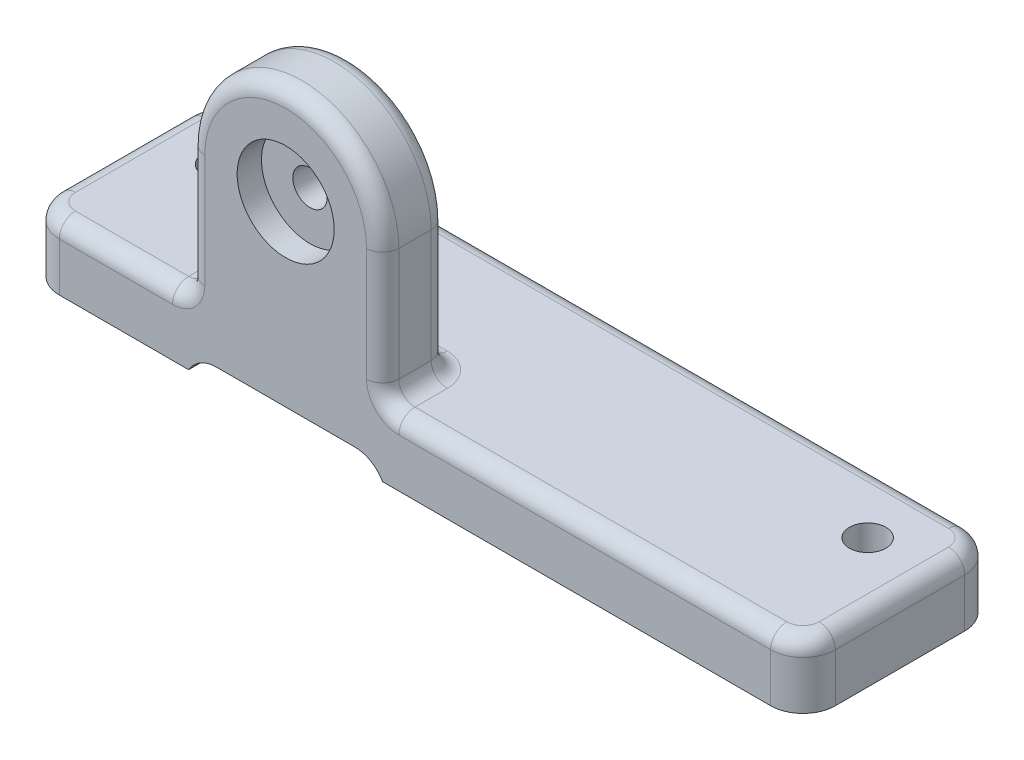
ISO-10303-21;
HEADER;
FILE_DESCRIPTION(('STEP AP214'),'2;1');
FILE_NAME('part.step','',(''),(''),'','','');
FILE_SCHEMA(('AUTOMOTIVE_DESIGN { 1 0 10303 214 1 1 1 1 }'));
ENDSEC;
DATA;
#1=APPLICATION_CONTEXT('core data for automotive mechanical design processes');
#2=APPLICATION_PROTOCOL_DEFINITION('international standard','automotive_design',2000,#1);
#3=PRODUCT_CONTEXT('',#1,'mechanical');
#4=PRODUCT('Part','Part','',(#3));
#5=PRODUCT_RELATED_PRODUCT_CATEGORY('part','',(#4));
#6=PRODUCT_DEFINITION_FORMATION('','',#4);
#7=PRODUCT_DEFINITION_CONTEXT('part definition',#1,'design');
#8=PRODUCT_DEFINITION('design','',#6,#7);
#9=PRODUCT_DEFINITION_SHAPE('','',#8);
#10=(LENGTH_UNIT() NAMED_UNIT(*) SI_UNIT(.MILLI.,.METRE.));
#11=(NAMED_UNIT(*) PLANE_ANGLE_UNIT() SI_UNIT($,.RADIAN.));
#12=(NAMED_UNIT(*) SI_UNIT($,.STERADIAN.) SOLID_ANGLE_UNIT());
#13=UNCERTAINTY_MEASURE_WITH_UNIT(LENGTH_MEASURE(1.E-05),#10,'distance_accuracy_value','');
#14=(GEOMETRIC_REPRESENTATION_CONTEXT(3) GLOBAL_UNCERTAINTY_ASSIGNED_CONTEXT((#13)) GLOBAL_UNIT_ASSIGNED_CONTEXT((#10,
#11,#12)) REPRESENTATION_CONTEXT('',''));
#15=CARTESIAN_POINT('',(0.,0.,0.));
#16=DIRECTION('',(0.,0.,1.));
#17=DIRECTION('',(1.,0.,0.));
#18=AXIS2_PLACEMENT_3D('',#15,#16,#17);
#19=CARTESIAN_POINT('',(0.,0.,-38.1));
#20=DIRECTION('',(0.,-1.,0.));
#21=DIRECTION('',(0.,0.,-1.));
#22=AXIS2_PLACEMENT_3D('',#19,#20,#21);
#23=PLANE('',#22);
#24=DIRECTION('',(0.,0.,1.));
#25=VECTOR('',#24,1.);
#26=CARTESIAN_POINT('',(0.,0.,0.));
#27=LINE('',#26,#25);
#28=CARTESIAN_POINT('',(0.,0.,-31.75));
#29=VERTEX_POINT('',#28);
#30=CARTESIAN_POINT('',(0.,0.,-6.35));
#31=VERTEX_POINT('',#30);
#32=EDGE_CURVE('E273',#29,#31,#27,.T.);
#33=ORIENTED_EDGE('',*,*,#32,.F.);
#34=CARTESIAN_POINT('',(6.35,0.,-31.75));
#35=DIRECTION('',(0.,-1.,0.));
#36=DIRECTION('',(0.,0.,-1.));
#37=AXIS2_PLACEMENT_3D('',#34,#35,#36);
#38=CIRCLE('',#37,6.35);
#39=CARTESIAN_POINT('',(6.35,0.,-38.1));
#40=VERTEX_POINT('',#39);
#41=EDGE_CURVE('E222',#29,#40,#38,.T.);
#42=ORIENTED_EDGE('',*,*,#41,.T.);
#43=DIRECTION('',(-1.,0.,0.));
#44=VECTOR('',#43,1.);
#45=CARTESIAN_POINT('',(0.,0.,-38.1));
#46=LINE('',#45,#44);
#47=CARTESIAN_POINT('',(31.75,0.,-38.1));
#48=VERTEX_POINT('',#47);
#49=EDGE_CURVE('E238',#48,#40,#46,.T.);
#50=ORIENTED_EDGE('',*,*,#49,.F.);
#51=DIRECTION('',(0.,0.,1.));
#52=VECTOR('',#51,1.);
#53=CARTESIAN_POINT('',(31.75,0.,-38.1));
#54=LINE('',#53,#52);
#55=CARTESIAN_POINT('',(31.75,0.,0.));
#56=VERTEX_POINT('',#55);
#57=EDGE_CURVE('E216',#48,#56,#54,.T.);
#58=ORIENTED_EDGE('',*,*,#57,.T.);
#59=DIRECTION('',(1.,0.,0.));
#60=VECTOR('',#59,1.);
#61=CARTESIAN_POINT('',(0.,0.,0.));
#62=LINE('',#61,#60);
#63=CARTESIAN_POINT('',(6.35,0.,0.));
#64=VERTEX_POINT('',#63);
#65=EDGE_CURVE('E225',#64,#56,#62,.T.);
#66=ORIENTED_EDGE('',*,*,#65,.F.);
#67=CARTESIAN_POINT('',(6.35,0.,-6.35));
#68=DIRECTION('',(0.,-1.,0.));
#69=DIRECTION('',(0.,0.,-1.));
#70=AXIS2_PLACEMENT_3D('',#67,#68,#69);
#71=CIRCLE('',#70,6.35);
#72=EDGE_CURVE('E311',#64,#31,#71,.T.);
#73=ORIENTED_EDGE('',*,*,#72,.T.);
#74=EDGE_LOOP('',(#33,#42,#50,#58,#66,#73));
#75=FACE_BOUND('',#74,.T.);
#76=CARTESIAN_POINT('',(12.7,0.,-25.4));
#77=DIRECTION('',(0.,1.,0.));
#78=DIRECTION('',(0.,0.,1.));
#79=AXIS2_PLACEMENT_3D('',#76,#77,#78);
#80=CIRCLE('',#79,3.57250999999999);
#81=CARTESIAN_POINT('',(12.7,0.,-21.82749));
#82=VERTEX_POINT('',#81);
#83=EDGE_CURVE('E264',#82,#82,#80,.T.);
#84=ORIENTED_EDGE('',*,*,#83,.T.);
#85=EDGE_LOOP('',(#84));
#86=FACE_BOUND('',#85,.T.);
#87=ADVANCED_FACE('F28',(#75,#86),#23,.T.);
#88=CARTESIAN_POINT('',(146.05,0.,-38.1));
#89=VERTEX_POINT('',#88);
#90=CARTESIAN_POINT('',(69.85,0.,-38.1));
#91=VERTEX_POINT('',#90);
#92=EDGE_CURVE('E280',#89,#91,#46,.T.);
#93=ORIENTED_EDGE('',*,*,#92,.F.);
#94=CARTESIAN_POINT('',(146.05,0.,-31.75));
#95=DIRECTION('',(0.,-1.,0.));
#96=DIRECTION('',(0.,0.,-1.));
#97=AXIS2_PLACEMENT_3D('',#94,#95,#96);
#98=CIRCLE('',#97,6.35);
#99=CARTESIAN_POINT('',(152.4,0.,-31.75));
#100=VERTEX_POINT('',#99);
#101=EDGE_CURVE('E295',#89,#100,#98,.T.);
#102=ORIENTED_EDGE('',*,*,#101,.T.);
#103=DIRECTION('',(0.,0.,-1.));
#104=VECTOR('',#103,1.);
#105=CARTESIAN_POINT('',(152.4,0.,0.));
#106=LINE('',#105,#104);
#107=CARTESIAN_POINT('',(152.4,0.,-6.35));
#108=VERTEX_POINT('',#107);
#109=EDGE_CURVE('E231',#108,#100,#106,.T.);
#110=ORIENTED_EDGE('',*,*,#109,.F.);
#111=CARTESIAN_POINT('',(146.05,0.,-6.35));
#112=DIRECTION('',(0.,-1.,0.));
#113=DIRECTION('',(0.,0.,-1.));
#114=AXIS2_PLACEMENT_3D('',#111,#112,#113);
#115=CIRCLE('',#114,6.35);
#116=CARTESIAN_POINT('',(146.05,0.,0.));
#117=VERTEX_POINT('',#116);
#118=EDGE_CURVE('E293',#108,#117,#115,.T.);
#119=ORIENTED_EDGE('',*,*,#118,.T.);
#120=CARTESIAN_POINT('',(69.85,0.,0.));
#121=VERTEX_POINT('',#120);
#122=EDGE_CURVE('E232',#121,#117,#62,.T.);
#123=ORIENTED_EDGE('',*,*,#122,.F.);
#124=DIRECTION('',(0.,0.,1.));
#125=VECTOR('',#124,1.);
#126=CARTESIAN_POINT('',(69.85,0.,-38.1));
#127=LINE('',#126,#125);
#128=EDGE_CURVE('E239',#91,#121,#127,.T.);
#129=ORIENTED_EDGE('',*,*,#128,.F.);
#130=EDGE_LOOP('',(#93,#102,#110,#119,#123,#129));
#131=FACE_BOUND('',#130,.T.);
#132=CARTESIAN_POINT('',(139.7,0.,-25.4));
#133=DIRECTION('',(0.,1.,0.));
#134=DIRECTION('',(0.,0.,1.));
#135=AXIS2_PLACEMENT_3D('',#132,#133,#134);
#136=CIRCLE('',#135,3.57251);
#137=CARTESIAN_POINT('',(139.7,0.,-21.82749));
#138=VERTEX_POINT('',#137);
#139=EDGE_CURVE('E258',#138,#138,#136,.T.);
#140=ORIENTED_EDGE('',*,*,#139,.T.);
#141=EDGE_LOOP('',(#140));
#142=FACE_BOUND('',#141,.T.);
#143=ADVANCED_FACE('F463',(#131,#142),#23,.T.);
#144=CARTESIAN_POINT('',(0.,12.7,0.));
#145=DIRECTION('',(1.,0.,0.));
#146=DIRECTION('',(0.,0.,-1.));
#147=AXIS2_PLACEMENT_3D('',#144,#145,#146);
#148=PLANE('',#147);
#149=DIRECTION('',(0.,-1.,0.));
#150=VECTOR('',#149,1.);
#151=CARTESIAN_POINT('',(0.,12.7,-6.35));
#152=LINE('',#151,#150);
#153=CARTESIAN_POINT('',(0.,9.525,-6.35));
#154=VERTEX_POINT('',#153);
#155=EDGE_CURVE('E306',#31,#154,#152,.F.);
#156=ORIENTED_EDGE('',*,*,#155,.T.);
#157=DIRECTION('',(0.,0.,1.));
#158=VECTOR('',#157,1.);
#159=CARTESIAN_POINT('',(0.,9.525,0.));
#160=LINE('',#159,#158);
#161=CARTESIAN_POINT('',(0.,9.525,-31.75));
#162=VERTEX_POINT('',#161);
#163=EDGE_CURVE('E353',#154,#162,#160,.F.);
#164=ORIENTED_EDGE('',*,*,#163,.T.);
#165=DIRECTION('',(0.,-1.,0.));
#166=VECTOR('',#165,1.);
#167=CARTESIAN_POINT('',(0.,12.7,-31.75));
#168=LINE('',#167,#166);
#169=EDGE_CURVE('E309',#162,#29,#168,.T.);
#170=ORIENTED_EDGE('',*,*,#169,.T.);
#171=ORIENTED_EDGE('',*,*,#32,.T.);
#172=EDGE_LOOP('',(#156,#164,#170,#171));
#173=FACE_BOUND('',#172,.T.);
#174=ADVANCED_FACE('F30',(#173),#148,.F.);
#175=CARTESIAN_POINT('',(0.,12.7,0.));
#176=DIRECTION('',(0.,0.,-1.));
#177=DIRECTION('',(-1.,0.,0.));
#178=AXIS2_PLACEMENT_3D('',#175,#176,#177);
#179=PLANE('',#178);
#180=CARTESIAN_POINT('',(50.8,38.1,0.));
#181=DIRECTION('',(0.,0.,1.));
#182=DIRECTION('',(1.,0.,0.));
#183=AXIS2_PLACEMENT_3D('',#180,#181,#182);
#184=CIRCLE('',#183,9.525);
#185=CARTESIAN_POINT('',(60.325,38.1,0.));
#186=VERTEX_POINT('',#185);
#187=EDGE_CURVE('E254',#186,#186,#184,.T.);
#188=ORIENTED_EDGE('',*,*,#187,.F.);
#189=EDGE_LOOP('',(#188));
#190=FACE_BOUND('',#189,.T.);
#191=CARTESIAN_POINT('',(28.575,15.875,0.));
#192=DIRECTION('',(0.,0.,-1.));
#193=DIRECTION('',(-1.,0.,0.));
#194=AXIS2_PLACEMENT_3D('',#191,#192,#193);
#195=CIRCLE('',#194,6.35);
#196=CARTESIAN_POINT('',(28.575,9.525,0.));
#197=VERTEX_POINT('',#196);
#198=CARTESIAN_POINT('',(34.925,15.875,0.));
#199=VERTEX_POINT('',#198);
#200=EDGE_CURVE('E372',#197,#199,#195,.F.);
#201=ORIENTED_EDGE('',*,*,#200,.F.);
#202=DIRECTION('',(1.,0.,0.));
#203=VECTOR('',#202,1.);
#204=CARTESIAN_POINT('',(0.,9.525,0.));
#205=LINE('',#204,#203);
#206=CARTESIAN_POINT('',(6.35,9.525,0.));
#207=VERTEX_POINT('',#206);
#208=EDGE_CURVE('E375',#197,#207,#205,.F.);
#209=ORIENTED_EDGE('',*,*,#208,.T.);
#210=DIRECTION('',(0.,-1.,0.));
#211=VECTOR('',#210,1.);
#212=CARTESIAN_POINT('',(6.35,12.7,0.));
#213=LINE('',#212,#211);
#214=EDGE_CURVE('E228',#207,#64,#213,.T.);
#215=ORIENTED_EDGE('',*,*,#214,.T.);
#216=ORIENTED_EDGE('',*,*,#65,.T.);
#217=CARTESIAN_POINT('',(37.2492613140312,-3.175,0.));
#218=DIRECTION('',(0.,0.,-1.));
#219=DIRECTION('',(-1.,0.,0.));
#220=AXIS2_PLACEMENT_3D('',#217,#218,#219);
#221=CIRCLE('',#220,6.35);
#222=CARTESIAN_POINT('',(37.2492613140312,3.175,0.));
#223=VERTEX_POINT('',#222);
#224=EDGE_CURVE('E211',#56,#223,#221,.T.);
#225=ORIENTED_EDGE('',*,*,#224,.T.);
#226=DIRECTION('',(-1.,0.,0.));
#227=VECTOR('',#226,1.);
#228=CARTESIAN_POINT('',(31.75,3.175,0.));
#229=LINE('',#228,#227);
#230=CARTESIAN_POINT('',(64.3507386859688,3.175,0.));
#231=VERTEX_POINT('',#230);
#232=EDGE_CURVE('E246',#231,#223,#229,.T.);
#233=ORIENTED_EDGE('',*,*,#232,.F.);
#234=CARTESIAN_POINT('',(64.3507386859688,-3.175,0.));
#235=DIRECTION('',(0.,0.,-1.));
#236=DIRECTION('',(-1.,0.,0.));
#237=AXIS2_PLACEMENT_3D('',#234,#235,#236);
#238=CIRCLE('',#237,6.35);
#239=EDGE_CURVE('E315',#231,#121,#238,.T.);
#240=ORIENTED_EDGE('',*,*,#239,.T.);
#241=ORIENTED_EDGE('',*,*,#122,.T.);
#242=DIRECTION('',(0.,-1.,0.));
#243=VECTOR('',#242,1.);
#244=CARTESIAN_POINT('',(146.05,12.7,0.));
#245=LINE('',#244,#243);
#246=CARTESIAN_POINT('',(146.05,9.525,0.));
#247=VERTEX_POINT('',#246);
#248=EDGE_CURVE('E303',#117,#247,#245,.F.);
#249=ORIENTED_EDGE('',*,*,#248,.T.);
#250=DIRECTION('',(1.,0.,0.));
#251=VECTOR('',#250,1.);
#252=CARTESIAN_POINT('',(0.,9.525,0.));
#253=LINE('',#252,#251);
#254=CARTESIAN_POINT('',(73.025,9.525,0.));
#255=VERTEX_POINT('',#254);
#256=EDGE_CURVE('E370',#247,#255,#253,.F.);
#257=ORIENTED_EDGE('',*,*,#256,.T.);
#258=CARTESIAN_POINT('',(73.025,15.875,0.));
#259=DIRECTION('',(0.,0.,-1.));
#260=DIRECTION('',(-1.,0.,0.));
#261=AXIS2_PLACEMENT_3D('',#258,#259,#260);
#262=CIRCLE('',#261,6.35);
#263=CARTESIAN_POINT('',(66.675,15.875,0.));
#264=VERTEX_POINT('',#263);
#265=EDGE_CURVE('E367',#264,#255,#262,.F.);
#266=ORIENTED_EDGE('',*,*,#265,.F.);
#267=DIRECTION('',(0.,1.,0.));
#268=VECTOR('',#267,1.);
#269=CARTESIAN_POINT('',(66.675,38.1,0.));
#270=LINE('',#269,#268);
#271=CARTESIAN_POINT('',(66.675,38.1,0.));
#272=VERTEX_POINT('',#271);
#273=EDGE_CURVE('E365',#264,#272,#270,.T.);
#274=ORIENTED_EDGE('',*,*,#273,.T.);
#275=CARTESIAN_POINT('',(50.8,38.1,0.));
#276=DIRECTION('',(0.,0.,-1.));
#277=DIRECTION('',(-1.,0.,0.));
#278=AXIS2_PLACEMENT_3D('',#275,#276,#277);
#279=CIRCLE('',#278,15.875);
#280=CARTESIAN_POINT('',(34.925,38.1,0.));
#281=VERTEX_POINT('',#280);
#282=EDGE_CURVE('E361',#272,#281,#279,.F.);
#283=ORIENTED_EDGE('',*,*,#282,.T.);
#284=DIRECTION('',(0.,-1.,0.));
#285=VECTOR('',#284,1.);
#286=CARTESIAN_POINT('',(34.925,12.7,0.));
#287=LINE('',#286,#285);
#288=EDGE_CURVE('E363',#281,#199,#287,.T.);
#289=ORIENTED_EDGE('',*,*,#288,.T.);
#290=EDGE_LOOP('',(#201,#209,#215,#216,#225,#233,#240,#241,#249,#257,#266,#274,#283,#289));
#291=FACE_BOUND('',#290,.T.);
#292=ADVANCED_FACE('F226',(#190,#291),#179,.F.);
#293=CARTESIAN_POINT('',(152.4,12.7,0.));
#294=DIRECTION('',(-1.,0.,0.));
#295=DIRECTION('',(0.,0.,1.));
#296=AXIS2_PLACEMENT_3D('',#293,#294,#295);
#297=PLANE('',#296);
#298=DIRECTION('',(0.,-1.,0.));
#299=VECTOR('',#298,1.);
#300=CARTESIAN_POINT('',(152.4,12.7,-31.75));
#301=LINE('',#300,#299);
#302=CARTESIAN_POINT('',(152.4,9.525,-31.75));
#303=VERTEX_POINT('',#302);
#304=EDGE_CURVE('E299',#100,#303,#301,.F.);
#305=ORIENTED_EDGE('',*,*,#304,.T.);
#306=DIRECTION('',(0.,0.,-1.));
#307=VECTOR('',#306,1.);
#308=CARTESIAN_POINT('',(152.4,9.525,0.));
#309=LINE('',#308,#307);
#310=CARTESIAN_POINT('',(152.4,9.525,-6.35));
#311=VERTEX_POINT('',#310);
#312=EDGE_CURVE('E377',#303,#311,#309,.F.);
#313=ORIENTED_EDGE('',*,*,#312,.T.);
#314=DIRECTION('',(0.,-1.,0.));
#315=VECTOR('',#314,1.);
#316=CARTESIAN_POINT('',(152.4,12.7,-6.35));
#317=LINE('',#316,#315);
#318=EDGE_CURVE('E297',#311,#108,#317,.T.);
#319=ORIENTED_EDGE('',*,*,#318,.T.);
#320=ORIENTED_EDGE('',*,*,#109,.T.);
#321=EDGE_LOOP('',(#305,#313,#319,#320));
#322=FACE_BOUND('',#321,.T.);
#323=ADVANCED_FACE('F476',(#322),#297,.F.);
#324=CARTESIAN_POINT('',(0.,12.7,-38.1));
#325=DIRECTION('',(0.,0.,1.));
#326=DIRECTION('',(1.,0.,0.));
#327=AXIS2_PLACEMENT_3D('',#324,#325,#326);
#328=PLANE('',#327);
#329=DIRECTION('',(0.,-1.,0.));
#330=VECTOR('',#329,1.);
#331=CARTESIAN_POINT('',(6.35,12.7,-38.1));
#332=LINE('',#331,#330);
#333=CARTESIAN_POINT('',(6.35,9.525,-38.1));
#334=VERTEX_POINT('',#333);
#335=EDGE_CURVE('E288',#40,#334,#332,.F.);
#336=ORIENTED_EDGE('',*,*,#335,.T.);
#337=DIRECTION('',(-1.,0.,0.));
#338=VECTOR('',#337,1.);
#339=CARTESIAN_POINT('',(0.,9.525,-38.1));
#340=LINE('',#339,#338);
#341=CARTESIAN_POINT('',(146.05,9.525,-38.1));
#342=VERTEX_POINT('',#341);
#343=EDGE_CURVE('E355',#334,#342,#340,.F.);
#344=ORIENTED_EDGE('',*,*,#343,.T.);
#345=DIRECTION('',(0.,-1.,0.));
#346=VECTOR('',#345,1.);
#347=CARTESIAN_POINT('',(146.05,12.7,-38.1));
#348=LINE('',#347,#346);
#349=EDGE_CURVE('E291',#342,#89,#348,.T.);
#350=ORIENTED_EDGE('',*,*,#349,.T.);
#351=ORIENTED_EDGE('',*,*,#92,.T.);
#352=CARTESIAN_POINT('',(64.3507386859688,-3.175,-38.1));
#353=DIRECTION('',(0.,0.,1.));
#354=DIRECTION('',(1.,0.,0.));
#355=AXIS2_PLACEMENT_3D('',#352,#353,#354);
#356=CIRCLE('',#355,6.35);
#357=CARTESIAN_POINT('',(64.3507386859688,3.175,-38.1));
#358=VERTEX_POINT('',#357);
#359=EDGE_CURVE('E317',#91,#358,#356,.T.);
#360=ORIENTED_EDGE('',*,*,#359,.T.);
#361=DIRECTION('',(-1.,0.,0.));
#362=VECTOR('',#361,1.);
#363=CARTESIAN_POINT('',(31.75,3.175,-38.1));
#364=LINE('',#363,#362);
#365=CARTESIAN_POINT('',(37.2492613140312,3.175,-38.1));
#366=VERTEX_POINT('',#365);
#367=EDGE_CURVE('E240',#358,#366,#364,.T.);
#368=ORIENTED_EDGE('',*,*,#367,.T.);
#369=CARTESIAN_POINT('',(37.2492613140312,-3.175,-38.1));
#370=DIRECTION('',(0.,0.,1.));
#371=DIRECTION('',(1.,0.,0.));
#372=AXIS2_PLACEMENT_3D('',#369,#370,#371);
#373=CIRCLE('',#372,6.35);
#374=EDGE_CURVE('E221',#366,#48,#373,.T.);
#375=ORIENTED_EDGE('',*,*,#374,.T.);
#376=ORIENTED_EDGE('',*,*,#49,.T.);
#377=EDGE_LOOP('',(#336,#344,#350,#351,#360,#368,#375,#376));
#378=FACE_BOUND('',#377,.T.);
#379=ADVANCED_FACE('F470',(#378),#328,.F.);
#380=CARTESIAN_POINT('',(0.,12.7,-38.1));
#381=DIRECTION('',(0.,-1.,0.));
#382=DIRECTION('',(0.,0.,-1.));
#383=AXIS2_PLACEMENT_3D('',#380,#381,#382);
#384=PLANE('',#383);
#385=DIRECTION('',(-1.,0.,0.));
#386=VECTOR('',#385,1.);
#387=CARTESIAN_POINT('',(0.,12.7,-34.925));
#388=LINE('',#387,#386);
#389=CARTESIAN_POINT('',(146.05,12.7,-34.925));
#390=VERTEX_POINT('',#389);
#391=CARTESIAN_POINT('',(6.35,12.7,-34.925));
#392=VERTEX_POINT('',#391);
#393=EDGE_CURVE('E343',#390,#392,#388,.T.);
#394=ORIENTED_EDGE('',*,*,#393,.T.);
#395=CARTESIAN_POINT('',(6.35,12.7,-31.75));
#396=DIRECTION('',(0.,-1.,0.));
#397=DIRECTION('',(0.,0.,-1.));
#398=AXIS2_PLACEMENT_3D('',#395,#396,#397);
#399=CIRCLE('',#398,3.175);
#400=CARTESIAN_POINT('',(3.175,12.7,-31.75));
#401=VERTEX_POINT('',#400);
#402=EDGE_CURVE('E347',#392,#401,#399,.F.);
#403=ORIENTED_EDGE('',*,*,#402,.T.);
#404=DIRECTION('',(0.,0.,1.));
#405=VECTOR('',#404,1.);
#406=CARTESIAN_POINT('',(3.175,12.7,-38.1));
#407=LINE('',#406,#405);
#408=CARTESIAN_POINT('',(3.175,12.7,-6.35));
#409=VERTEX_POINT('',#408);
#410=EDGE_CURVE('E345',#401,#409,#407,.T.);
#411=ORIENTED_EDGE('',*,*,#410,.T.);
#412=CARTESIAN_POINT('',(6.35,12.7,-6.35));
#413=DIRECTION('',(0.,-1.,0.));
#414=DIRECTION('',(0.,0.,-1.));
#415=AXIS2_PLACEMENT_3D('',#412,#413,#414);
#416=CIRCLE('',#415,3.175);
#417=CARTESIAN_POINT('',(6.35,12.7,-3.175));
#418=VERTEX_POINT('',#417);
#419=EDGE_CURVE('E341',#409,#418,#416,.F.);
#420=ORIENTED_EDGE('',*,*,#419,.T.);
#421=DIRECTION('',(1.,0.,0.));
#422=VECTOR('',#421,1.);
#423=CARTESIAN_POINT('',(0.,12.7,-3.175));
#424=LINE('',#423,#422);
#425=CARTESIAN_POINT('',(28.575,12.7,-3.175));
#426=VERTEX_POINT('',#425);
#427=EDGE_CURVE('E337',#418,#426,#424,.T.);
#428=ORIENTED_EDGE('',*,*,#427,.T.);
#429=DIRECTION('',(0.,0.,-1.));
#430=VECTOR('',#429,1.);
#431=CARTESIAN_POINT('',(28.575,12.7,-38.1));
#432=LINE('',#431,#430);
#433=CARTESIAN_POINT('',(28.575,12.7,-9.525));
#434=VERTEX_POINT('',#433);
#435=EDGE_CURVE('E333',#426,#434,#432,.T.);
#436=ORIENTED_EDGE('',*,*,#435,.T.);
#437=CARTESIAN_POINT('',(34.925,12.7,-9.525));
#438=DIRECTION('',(0.,-1.,0.));
#439=DIRECTION('',(0.,0.,-1.));
#440=AXIS2_PLACEMENT_3D('',#437,#438,#439);
#441=CIRCLE('',#440,6.35);
#442=CARTESIAN_POINT('',(34.925,12.7,-15.875));
#443=VERTEX_POINT('',#442);
#444=EDGE_CURVE('E330',#443,#434,#441,.F.);
#445=ORIENTED_EDGE('',*,*,#444,.F.);
#446=DIRECTION('',(1.,0.,0.));
#447=VECTOR('',#446,1.);
#448=CARTESIAN_POINT('',(0.,12.7,-15.875));
#449=LINE('',#448,#447);
#450=CARTESIAN_POINT('',(66.675,12.7,-15.875));
#451=VERTEX_POINT('',#450);
#452=EDGE_CURVE('E326',#443,#451,#449,.T.);
#453=ORIENTED_EDGE('',*,*,#452,.T.);
#454=CARTESIAN_POINT('',(66.675,12.7,-9.525));
#455=DIRECTION('',(0.,-1.,0.));
#456=DIRECTION('',(0.,0.,-1.));
#457=AXIS2_PLACEMENT_3D('',#454,#455,#456);
#458=CIRCLE('',#457,6.35);
#459=CARTESIAN_POINT('',(73.025,12.7,-9.525));
#460=VERTEX_POINT('',#459);
#461=EDGE_CURVE('E323',#460,#451,#458,.F.);
#462=ORIENTED_EDGE('',*,*,#461,.F.);
#463=DIRECTION('',(0.,0.,1.));
#464=VECTOR('',#463,1.);
#465=CARTESIAN_POINT('',(73.025,12.7,-38.1));
#466=LINE('',#465,#464);
#467=CARTESIAN_POINT('',(73.025,12.7,-3.175));
#468=VERTEX_POINT('',#467);
#469=EDGE_CURVE('E319',#460,#468,#466,.T.);
#470=ORIENTED_EDGE('',*,*,#469,.T.);
#471=DIRECTION('',(1.,0.,0.));
#472=VECTOR('',#471,1.);
#473=CARTESIAN_POINT('',(0.,12.7,-3.175));
#474=LINE('',#473,#472);
#475=CARTESIAN_POINT('',(146.05,12.7,-3.175));
#476=VERTEX_POINT('',#475);
#477=EDGE_CURVE('E321',#468,#476,#474,.T.);
#478=ORIENTED_EDGE('',*,*,#477,.T.);
#479=CARTESIAN_POINT('',(146.05,12.7,-6.35));
#480=DIRECTION('',(0.,-1.,0.));
#481=DIRECTION('',(0.,0.,-1.));
#482=AXIS2_PLACEMENT_3D('',#479,#480,#481);
#483=CIRCLE('',#482,3.175);
#484=CARTESIAN_POINT('',(149.225,12.7,-6.35));
#485=VERTEX_POINT('',#484);
#486=EDGE_CURVE('E328',#476,#485,#483,.F.);
#487=ORIENTED_EDGE('',*,*,#486,.T.);
#488=DIRECTION('',(0.,0.,-1.));
#489=VECTOR('',#488,1.);
#490=CARTESIAN_POINT('',(149.225,12.7,-38.1));
#491=LINE('',#490,#489);
#492=CARTESIAN_POINT('',(149.225,12.7,-31.75));
#493=VERTEX_POINT('',#492);
#494=EDGE_CURVE('E335',#485,#493,#491,.T.);
#495=ORIENTED_EDGE('',*,*,#494,.T.);
#496=CARTESIAN_POINT('',(146.05,12.7,-31.75));
#497=DIRECTION('',(0.,-1.,0.));
#498=DIRECTION('',(0.,0.,-1.));
#499=AXIS2_PLACEMENT_3D('',#496,#497,#498);
#500=CIRCLE('',#499,3.175);
#501=EDGE_CURVE('E339',#493,#390,#500,.F.);
#502=ORIENTED_EDGE('',*,*,#501,.T.);
#503=EDGE_LOOP('',(#394,#403,#411,#420,#428,#436,#445,#453,#462,#470,#478,#487,#495,#502));
#504=FACE_BOUND('',#503,.T.);
#505=CARTESIAN_POINT('',(139.7,12.7,-25.4));
#506=DIRECTION('',(0.,1.,0.));
#507=DIRECTION('',(0.,0.,1.));
#508=AXIS2_PLACEMENT_3D('',#505,#506,#507);
#509=CIRCLE('',#508,3.57251);
#510=CARTESIAN_POINT('',(139.7,12.7,-21.82749));
#511=VERTEX_POINT('',#510);
#512=EDGE_CURVE('E261',#511,#511,#509,.T.);
#513=ORIENTED_EDGE('',*,*,#512,.F.);
#514=EDGE_LOOP('',(#513));
#515=FACE_BOUND('',#514,.T.);
#516=CARTESIAN_POINT('',(12.7,12.7,-25.4));
#517=DIRECTION('',(0.,1.,0.));
#518=DIRECTION('',(0.,0.,1.));
#519=AXIS2_PLACEMENT_3D('',#516,#517,#518);
#520=CIRCLE('',#519,3.57250999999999);
#521=CARTESIAN_POINT('',(12.7,12.7,-21.82749));
#522=VERTEX_POINT('',#521);
#523=EDGE_CURVE('E267',#522,#522,#520,.T.);
#524=ORIENTED_EDGE('',*,*,#523,.F.);
#525=EDGE_LOOP('',(#524));
#526=FACE_BOUND('',#525,.T.);
#527=ADVANCED_FACE('F534',(#504,#515,#526),#384,.F.);
#528=CARTESIAN_POINT('',(69.85,38.1,-12.7));
#529=DIRECTION('',(1.,0.,0.));
#530=DIRECTION('',(0.,1.,0.));
#531=AXIS2_PLACEMENT_3D('',#528,#529,#530);
#532=PLANE('',#531);
#533=DIRECTION('',(0.,0.,1.));
#534=VECTOR('',#533,1.);
#535=CARTESIAN_POINT('',(69.85,15.875,-12.7));
#536=LINE('',#535,#534);
#537=CARTESIAN_POINT('',(69.85,15.875,-3.175));
#538=VERTEX_POINT('',#537);
#539=CARTESIAN_POINT('',(69.85,15.875,-9.525));
#540=VERTEX_POINT('',#539);
#541=EDGE_CURVE('E43',#538,#540,#536,.F.);
#542=ORIENTED_EDGE('',*,*,#541,.T.);
#543=DIRECTION('',(0.,1.,0.));
#544=VECTOR('',#543,1.);
#545=CARTESIAN_POINT('',(69.85,38.1,-9.525));
#546=LINE('',#545,#544);
#547=CARTESIAN_POINT('',(69.85,38.1,-9.525));
#548=VERTEX_POINT('',#547);
#549=EDGE_CURVE('E399',#540,#548,#546,.T.);
#550=ORIENTED_EDGE('',*,*,#549,.T.);
#551=DIRECTION('',(0.,0.,1.));
#552=VECTOR('',#551,1.);
#553=CARTESIAN_POINT('',(69.85,38.1,-12.7));
#554=LINE('',#553,#552);
#555=CARTESIAN_POINT('',(69.85,38.1,-3.175));
#556=VERTEX_POINT('',#555);
#557=EDGE_CURVE('E271',#548,#556,#554,.T.);
#558=ORIENTED_EDGE('',*,*,#557,.T.);
#559=DIRECTION('',(0.,1.,0.));
#560=VECTOR('',#559,1.);
#561=CARTESIAN_POINT('',(69.85,12.7,-3.175));
#562=LINE('',#561,#560);
#563=EDGE_CURVE('E48',#556,#538,#562,.F.);
#564=ORIENTED_EDGE('',*,*,#563,.T.);
#565=EDGE_LOOP('',(#542,#550,#558,#564));
#566=FACE_BOUND('',#565,.T.);
#567=ADVANCED_FACE('F410',(#566),#532,.T.);
#568=CARTESIAN_POINT('',(31.75,0.,-12.7));
#569=DIRECTION('',(-1.,0.,0.));
#570=DIRECTION('',(0.,0.,1.));
#571=AXIS2_PLACEMENT_3D('',#568,#569,#570);
#572=PLANE('',#571);
#573=DIRECTION('',(0.,0.,1.));
#574=VECTOR('',#573,1.);
#575=CARTESIAN_POINT('',(31.75,38.1,-12.7));
#576=LINE('',#575,#574);
#577=CARTESIAN_POINT('',(31.75,38.1,-9.525));
#578=VERTEX_POINT('',#577);
#579=CARTESIAN_POINT('',(31.75,38.1,-3.175));
#580=VERTEX_POINT('',#579);
#581=EDGE_CURVE('E270',#578,#580,#576,.T.);
#582=ORIENTED_EDGE('',*,*,#581,.F.);
#583=DIRECTION('',(0.,-1.,0.));
#584=VECTOR('',#583,1.);
#585=CARTESIAN_POINT('',(31.75,0.,-9.525));
#586=LINE('',#585,#584);
#587=CARTESIAN_POINT('',(31.75,15.875,-9.525));
#588=VERTEX_POINT('',#587);
#589=EDGE_CURVE('E384',#578,#588,#586,.T.);
#590=ORIENTED_EDGE('',*,*,#589,.T.);
#591=DIRECTION('',(0.,0.,-1.));
#592=VECTOR('',#591,1.);
#593=CARTESIAN_POINT('',(31.75,15.875,-12.7));
#594=LINE('',#593,#592);
#595=CARTESIAN_POINT('',(31.75,15.875,-3.175));
#596=VERTEX_POINT('',#595);
#597=EDGE_CURVE('E381',#588,#596,#594,.F.);
#598=ORIENTED_EDGE('',*,*,#597,.T.);
#599=DIRECTION('',(0.,-1.,0.));
#600=VECTOR('',#599,1.);
#601=CARTESIAN_POINT('',(31.75,38.1,-3.175));
#602=LINE('',#601,#600);
#603=EDGE_CURVE('E379',#596,#580,#602,.F.);
#604=ORIENTED_EDGE('',*,*,#603,.T.);
#605=EDGE_LOOP('',(#582,#590,#598,#604));
#606=FACE_BOUND('',#605,.T.);
#607=ADVANCED_FACE('F657',(#606),#572,.T.);
#608=CARTESIAN_POINT('',(50.8,38.1,-12.7));
#609=DIRECTION('',(0.,0.,-1.));
#610=DIRECTION('',(-1.,0.,0.));
#611=AXIS2_PLACEMENT_3D('',#608,#609,#610);
#612=PLANE('',#611);
#613=DIRECTION('',(0.,1.,0.));
#614=VECTOR('',#613,1.);
#615=CARTESIAN_POINT('',(66.675,38.1,-12.7));
#616=LINE('',#615,#614);
#617=CARTESIAN_POINT('',(66.675,38.1,-12.7));
#618=VERTEX_POINT('',#617);
#619=CARTESIAN_POINT('',(66.675,15.875,-12.7));
#620=VERTEX_POINT('',#619);
#621=EDGE_CURVE('E392',#618,#620,#616,.F.);
#622=ORIENTED_EDGE('',*,*,#621,.T.);
#623=DIRECTION('',(1.,0.,0.));
#624=VECTOR('',#623,1.);
#625=CARTESIAN_POINT('',(50.8,15.875,-12.7));
#626=LINE('',#625,#624);
#627=CARTESIAN_POINT('',(34.925,15.875,-12.7));
#628=VERTEX_POINT('',#627);
#629=EDGE_CURVE('E394',#620,#628,#626,.F.);
#630=ORIENTED_EDGE('',*,*,#629,.T.);
#631=DIRECTION('',(0.,-1.,0.));
#632=VECTOR('',#631,1.);
#633=CARTESIAN_POINT('',(34.925,38.1,-12.7));
#634=LINE('',#633,#632);
#635=CARTESIAN_POINT('',(34.925,38.1,-12.7));
#636=VERTEX_POINT('',#635);
#637=EDGE_CURVE('E390',#628,#636,#634,.F.);
#638=ORIENTED_EDGE('',*,*,#637,.T.);
#639=CARTESIAN_POINT('',(50.8,38.1,-12.7));
#640=DIRECTION('',(0.,0.,-1.));
#641=DIRECTION('',(-1.,0.,0.));
#642=AXIS2_PLACEMENT_3D('',#639,#640,#641);
#643=CIRCLE('',#642,15.875);
#644=EDGE_CURVE('E388',#636,#618,#643,.T.);
#645=ORIENTED_EDGE('',*,*,#644,.T.);
#646=EDGE_LOOP('',(#622,#630,#638,#645));
#647=FACE_BOUND('',#646,.T.);
#648=CARTESIAN_POINT('',(50.8,38.1,-12.7));
#649=DIRECTION('',(0.,0.,-1.));
#650=DIRECTION('',(-1.,0.,0.));
#651=AXIS2_PLACEMENT_3D('',#648,#649,#650);
#652=CIRCLE('',#651,3.3782);
#653=CARTESIAN_POINT('',(47.4218,38.1,-12.7));
#654=VERTEX_POINT('',#653);
#655=EDGE_CURVE('E257',#654,#654,#652,.T.);
#656=ORIENTED_EDGE('',*,*,#655,.F.);
#657=EDGE_LOOP('',(#656));
#658=FACE_BOUND('',#657,.T.);
#659=ADVANCED_FACE('F654',(#647,#658),#612,.T.);
#660=CARTESIAN_POINT('',(50.8,38.1,-12.7));
#661=DIRECTION('',(0.,0.,1.));
#662=DIRECTION('',(1.,0.,0.));
#663=AXIS2_PLACEMENT_3D('',#660,#661,#662);
#664=CYLINDRICAL_SURFACE('',#663,19.05);
#665=ORIENTED_EDGE('',*,*,#557,.F.);
#666=CARTESIAN_POINT('',(50.8,38.1,-9.525));
#667=DIRECTION('',(0.,0.,-1.));
#668=DIRECTION('',(-1.,0.,0.));
#669=AXIS2_PLACEMENT_3D('',#666,#667,#668);
#670=CIRCLE('',#669,19.05);
#671=EDGE_CURVE('E11',#548,#578,#670,.F.);
#672=ORIENTED_EDGE('',*,*,#671,.T.);
#673=ORIENTED_EDGE('',*,*,#581,.T.);
#674=CARTESIAN_POINT('',(50.8,38.1,-3.175));
#675=DIRECTION('',(0.,0.,-1.));
#676=DIRECTION('',(-1.,0.,0.));
#677=AXIS2_PLACEMENT_3D('',#674,#675,#676);
#678=CIRCLE('',#677,19.05);
#679=EDGE_CURVE('E36',#580,#556,#678,.T.);
#680=ORIENTED_EDGE('',*,*,#679,.T.);
#681=EDGE_LOOP('',(#665,#672,#673,#680));
#682=FACE_BOUND('',#681,.T.);
#683=ADVANCED_FACE('F403',(#682),#664,.T.);
#684=CARTESIAN_POINT('',(12.7,12.7,-25.4));
#685=DIRECTION('',(0.,1.,0.));
#686=DIRECTION('',(0.,0.,1.));
#687=AXIS2_PLACEMENT_3D('',#684,#685,#686);
#688=CYLINDRICAL_SURFACE('',#687,3.57250999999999);
#689=ORIENTED_EDGE('',*,*,#83,.F.);
#690=EDGE_LOOP('',(#689));
#691=FACE_BOUND('',#690,.T.);
#692=ORIENTED_EDGE('',*,*,#523,.T.);
#693=EDGE_LOOP('',(#692));
#694=FACE_BOUND('',#693,.T.);
#695=ADVANCED_FACE('F645',(#691,#694),#688,.F.);
#696=CARTESIAN_POINT('',(139.7,12.7,-25.4));
#697=DIRECTION('',(0.,1.,0.));
#698=DIRECTION('',(0.,0.,1.));
#699=AXIS2_PLACEMENT_3D('',#696,#697,#698);
#700=CYLINDRICAL_SURFACE('',#699,3.57251);
#701=ORIENTED_EDGE('',*,*,#139,.F.);
#702=EDGE_LOOP('',(#701));
#703=FACE_BOUND('',#702,.T.);
#704=ORIENTED_EDGE('',*,*,#512,.T.);
#705=EDGE_LOOP('',(#704));
#706=FACE_BOUND('',#705,.T.);
#707=ADVANCED_FACE('F635',(#703,#706),#700,.F.);
#708=CARTESIAN_POINT('',(50.8,38.1,0.));
#709=DIRECTION('',(0.,0.,1.));
#710=DIRECTION('',(1.,0.,0.));
#711=AXIS2_PLACEMENT_3D('',#708,#709,#710);
#712=CYLINDRICAL_SURFACE('',#711,9.525);
#713=CARTESIAN_POINT('',(50.8,38.1,-4.7752));
#714=DIRECTION('',(0.,0.,1.));
#715=DIRECTION('',(1.,0.,0.));
#716=AXIS2_PLACEMENT_3D('',#713,#714,#715);
#717=CIRCLE('',#716,9.525);
#718=CARTESIAN_POINT('',(60.325,38.1,-4.7752));
#719=VERTEX_POINT('',#718);
#720=EDGE_CURVE('E251',#719,#719,#717,.T.);
#721=ORIENTED_EDGE('',*,*,#720,.F.);
#722=EDGE_LOOP('',(#721));
#723=FACE_BOUND('',#722,.T.);
#724=ORIENTED_EDGE('',*,*,#187,.T.);
#725=EDGE_LOOP('',(#724));
#726=FACE_BOUND('',#725,.T.);
#727=ADVANCED_FACE('F632',(#723,#726),#712,.F.);
#728=CARTESIAN_POINT('',(54.1782,38.1,-4.7752));
#729=DIRECTION('',(0.,0.,-1.));
#730=DIRECTION('',(-1.,0.,0.));
#731=AXIS2_PLACEMENT_3D('',#728,#729,#730);
#732=PLANE('',#731);
#733=CARTESIAN_POINT('',(50.8,38.1,-4.7752));
#734=DIRECTION('',(0.,0.,1.));
#735=DIRECTION('',(1.,0.,0.));
#736=AXIS2_PLACEMENT_3D('',#733,#734,#735);
#737=CIRCLE('',#736,3.3782);
#738=CARTESIAN_POINT('',(54.1782,38.1,-4.7752));
#739=VERTEX_POINT('',#738);
#740=EDGE_CURVE('E243',#739,#739,#737,.T.);
#741=ORIENTED_EDGE('',*,*,#740,.F.);
#742=EDGE_LOOP('',(#741));
#743=FACE_BOUND('',#742,.T.);
#744=ORIENTED_EDGE('',*,*,#720,.T.);
#745=EDGE_LOOP('',(#744));
#746=FACE_BOUND('',#745,.T.);
#747=ADVANCED_FACE('F634',(#743,#746),#732,.F.);
#748=CARTESIAN_POINT('',(50.8,38.1,0.));
#749=DIRECTION('',(0.,0.,1.));
#750=DIRECTION('',(1.,0.,0.));
#751=AXIS2_PLACEMENT_3D('',#748,#749,#750);
#752=CYLINDRICAL_SURFACE('',#751,3.3782);
#753=ORIENTED_EDGE('',*,*,#655,.T.);
#754=EDGE_LOOP('',(#753));
#755=FACE_BOUND('',#754,.T.);
#756=ORIENTED_EDGE('',*,*,#740,.T.);
#757=EDGE_LOOP('',(#756));
#758=FACE_BOUND('',#757,.T.);
#759=ADVANCED_FACE('F642',(#755,#758),#752,.F.);
#760=CARTESIAN_POINT('',(31.75,3.175,-38.1));
#761=DIRECTION('',(0.,1.,0.));
#762=DIRECTION('',(0.,0.,1.));
#763=AXIS2_PLACEMENT_3D('',#760,#761,#762);
#764=PLANE('',#763);
#765=ORIENTED_EDGE('',*,*,#232,.T.);
#766=DIRECTION('',(0.,0.,1.));
#767=VECTOR('',#766,1.);
#768=CARTESIAN_POINT('',(37.2492613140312,3.175,-38.1));
#769=LINE('',#768,#767);
#770=EDGE_CURVE('E217',#223,#366,#769,.F.);
#771=ORIENTED_EDGE('',*,*,#770,.T.);
#772=ORIENTED_EDGE('',*,*,#367,.F.);
#773=DIRECTION('',(0.,0.,-1.));
#774=VECTOR('',#773,1.);
#775=CARTESIAN_POINT('',(64.3507386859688,3.175,-38.1));
#776=LINE('',#775,#774);
#777=EDGE_CURVE('E282',#358,#231,#776,.F.);
#778=ORIENTED_EDGE('',*,*,#777,.T.);
#779=EDGE_LOOP('',(#765,#771,#772,#778));
#780=FACE_BOUND('',#779,.T.);
#781=ADVANCED_FACE('F453',(#780),#764,.F.);
#782=CARTESIAN_POINT('',(37.2492613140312,-3.175,-38.1));
#783=DIRECTION('',(0.,0.,1.));
#784=DIRECTION('',(1.,0.,0.));
#785=AXIS2_PLACEMENT_3D('',#782,#783,#784);
#786=CYLINDRICAL_SURFACE('',#785,6.35);
#787=ORIENTED_EDGE('',*,*,#374,.F.);
#788=ORIENTED_EDGE('',*,*,#770,.F.);
#789=ORIENTED_EDGE('',*,*,#224,.F.);
#790=ORIENTED_EDGE('',*,*,#57,.F.);
#791=EDGE_LOOP('',(#787,#788,#789,#790));
#792=FACE_BOUND('',#791,.T.);
#793=ADVANCED_FACE('F214',(#792),#786,.F.);
#794=CARTESIAN_POINT('',(64.3507386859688,-3.175,-38.1));
#795=DIRECTION('',(0.,0.,-1.));
#796=DIRECTION('',(-1.,0.,0.));
#797=AXIS2_PLACEMENT_3D('',#794,#795,#796);
#798=CYLINDRICAL_SURFACE('',#797,6.35);
#799=ORIENTED_EDGE('',*,*,#359,.F.);
#800=ORIENTED_EDGE('',*,*,#128,.T.);
#801=ORIENTED_EDGE('',*,*,#239,.F.);
#802=ORIENTED_EDGE('',*,*,#777,.F.);
#803=EDGE_LOOP('',(#799,#800,#801,#802));
#804=FACE_BOUND('',#803,.T.);
#805=ADVANCED_FACE('F468',(#804),#798,.F.);
#806=CARTESIAN_POINT('',(146.05,12.7,-31.75));
#807=DIRECTION('',(0.,-1.,0.));
#808=DIRECTION('',(0.,0.,-1.));
#809=AXIS2_PLACEMENT_3D('',#806,#807,#808);
#810=CYLINDRICAL_SURFACE('',#809,6.35);
#811=ORIENTED_EDGE('',*,*,#349,.F.);
#812=CARTESIAN_POINT('',(146.05,9.525,-31.75));
#813=DIRECTION('',(0.,-1.,0.));
#814=DIRECTION('',(0.,0.,-1.));
#815=AXIS2_PLACEMENT_3D('',#812,#813,#814);
#816=CIRCLE('',#815,6.35);
#817=EDGE_CURVE('E359',#342,#303,#816,.T.);
#818=ORIENTED_EDGE('',*,*,#817,.T.);
#819=ORIENTED_EDGE('',*,*,#304,.F.);
#820=ORIENTED_EDGE('',*,*,#101,.F.);
#821=EDGE_LOOP('',(#811,#818,#819,#820));
#822=FACE_BOUND('',#821,.T.);
#823=ADVANCED_FACE('F479',(#822),#810,.T.);
#824=CARTESIAN_POINT('',(146.05,12.7,-6.35));
#825=DIRECTION('',(0.,-1.,0.));
#826=DIRECTION('',(0.,0.,-1.));
#827=AXIS2_PLACEMENT_3D('',#824,#825,#826);
#828=CYLINDRICAL_SURFACE('',#827,6.35);
#829=ORIENTED_EDGE('',*,*,#318,.F.);
#830=CARTESIAN_POINT('',(146.05,9.525,-6.35));
#831=DIRECTION('',(0.,-1.,0.));
#832=DIRECTION('',(0.,0.,-1.));
#833=AXIS2_PLACEMENT_3D('',#830,#831,#832);
#834=CIRCLE('',#833,6.35);
#835=EDGE_CURVE('E386',#311,#247,#834,.T.);
#836=ORIENTED_EDGE('',*,*,#835,.T.);
#837=ORIENTED_EDGE('',*,*,#248,.F.);
#838=ORIENTED_EDGE('',*,*,#118,.F.);
#839=EDGE_LOOP('',(#829,#836,#837,#838));
#840=FACE_BOUND('',#839,.T.);
#841=ADVANCED_FACE('F566',(#840),#828,.T.);
#842=CARTESIAN_POINT('',(6.35,12.7,-31.75));
#843=DIRECTION('',(0.,-1.,0.));
#844=DIRECTION('',(0.,0.,-1.));
#845=AXIS2_PLACEMENT_3D('',#842,#843,#844);
#846=CYLINDRICAL_SURFACE('',#845,6.35);
#847=ORIENTED_EDGE('',*,*,#169,.F.);
#848=CARTESIAN_POINT('',(6.35,9.525,-31.75));
#849=DIRECTION('',(0.,-1.,0.));
#850=DIRECTION('',(0.,0.,-1.));
#851=AXIS2_PLACEMENT_3D('',#848,#849,#850);
#852=CIRCLE('',#851,6.35);
#853=EDGE_CURVE('E350',#162,#334,#852,.T.);
#854=ORIENTED_EDGE('',*,*,#853,.T.);
#855=ORIENTED_EDGE('',*,*,#335,.F.);
#856=ORIENTED_EDGE('',*,*,#41,.F.);
#857=EDGE_LOOP('',(#847,#854,#855,#856));
#858=FACE_BOUND('',#857,.T.);
#859=ADVANCED_FACE('F599',(#858),#846,.T.);
#860=CARTESIAN_POINT('',(6.35,12.7,-6.35));
#861=DIRECTION('',(0.,-1.,0.));
#862=DIRECTION('',(0.,0.,-1.));
#863=AXIS2_PLACEMENT_3D('',#860,#861,#862);
#864=CYLINDRICAL_SURFACE('',#863,6.35);
#865=ORIENTED_EDGE('',*,*,#214,.F.);
#866=CARTESIAN_POINT('',(6.35,9.525,-6.35));
#867=DIRECTION('',(0.,-1.,0.));
#868=DIRECTION('',(0.,0.,-1.));
#869=AXIS2_PLACEMENT_3D('',#866,#867,#868);
#870=CIRCLE('',#869,6.35);
#871=EDGE_CURVE('E357',#207,#154,#870,.T.);
#872=ORIENTED_EDGE('',*,*,#871,.T.);
#873=ORIENTED_EDGE('',*,*,#155,.F.);
#874=ORIENTED_EDGE('',*,*,#72,.F.);
#875=EDGE_LOOP('',(#865,#872,#873,#874));
#876=FACE_BOUND('',#875,.T.);
#877=ADVANCED_FACE('F579',(#876),#864,.T.);
#878=CARTESIAN_POINT('',(66.675,38.1,-9.525));
#879=DIRECTION('',(0.,1.,0.));
#880=DIRECTION('',(-1.,0.,0.));
#881=AXIS2_PLACEMENT_3D('',#878,#879,#880);
#882=CYLINDRICAL_SURFACE('',#881,3.175);
#883=CARTESIAN_POINT('',(66.675,15.875,-9.525));
#884=DIRECTION('',(0.,-1.,0.));
#885=DIRECTION('',(0.,0.,-1.));
#886=AXIS2_PLACEMENT_3D('',#883,#884,#885);
#887=CIRCLE('',#886,3.175);
#888=EDGE_CURVE('E449',#620,#540,#887,.T.);
#889=ORIENTED_EDGE('',*,*,#888,.F.);
#890=ORIENTED_EDGE('',*,*,#621,.F.);
#891=CARTESIAN_POINT('',(66.675,38.1,-9.525));
#892=DIRECTION('',(0.,1.,0.));
#893=DIRECTION('',(0.,0.,1.));
#894=AXIS2_PLACEMENT_3D('',#891,#892,#893);
#895=CIRCLE('',#894,3.175);
#896=EDGE_CURVE('E446',#548,#618,#895,.T.);
#897=ORIENTED_EDGE('',*,*,#896,.F.);
#898=ORIENTED_EDGE('',*,*,#549,.F.);
#899=EDGE_LOOP('',(#889,#890,#897,#898));
#900=FACE_BOUND('',#899,.T.);
#901=ADVANCED_FACE('F675',(#900),#882,.T.);
#902=CARTESIAN_POINT('',(66.675,15.875,-9.525));
#903=DIRECTION('',(0.,-1.,0.));
#904=DIRECTION('',(0.,0.,-1.));
#905=AXIS2_PLACEMENT_3D('',#902,#903,#904);
#906=TOROIDAL_SURFACE('',#905,6.35,3.175);
#907=CARTESIAN_POINT('',(66.675,15.875,-15.875));
#908=DIRECTION('',(-1.,0.,0.));
#909=DIRECTION('',(0.,0.,1.));
#910=AXIS2_PLACEMENT_3D('',#907,#908,#909);
#911=CIRCLE('',#910,3.175);
#912=EDGE_CURVE('E440',#620,#451,#911,.F.);
#913=ORIENTED_EDGE('',*,*,#912,.F.);
#914=ORIENTED_EDGE('',*,*,#888,.T.);
#915=CARTESIAN_POINT('',(73.025,15.875,-9.525));
#916=DIRECTION('',(0.,0.,1.));
#917=DIRECTION('',(1.,0.,0.));
#918=AXIS2_PLACEMENT_3D('',#915,#916,#917);
#919=CIRCLE('',#918,3.175);
#920=EDGE_CURVE('E443',#460,#540,#919,.F.);
#921=ORIENTED_EDGE('',*,*,#920,.F.);
#922=ORIENTED_EDGE('',*,*,#461,.T.);
#923=EDGE_LOOP('',(#913,#914,#921,#922));
#924=FACE_BOUND('',#923,.T.);
#925=ADVANCED_FACE('F542',(#924),#906,.F.);
#926=CARTESIAN_POINT('',(50.8,38.1,-9.525));
#927=DIRECTION('',(0.,0.,-1.));
#928=DIRECTION('',(-1.,0.,0.));
#929=AXIS2_PLACEMENT_3D('',#926,#927,#928);
#930=TOROIDAL_SURFACE('',#929,15.875,3.175);
#931=ORIENTED_EDGE('',*,*,#896,.T.);
#932=ORIENTED_EDGE('',*,*,#644,.F.);
#933=CARTESIAN_POINT('',(34.925,38.1,-9.525));
#934=DIRECTION('',(0.,-1.,0.));
#935=DIRECTION('',(0.,0.,-1.));
#936=AXIS2_PLACEMENT_3D('',#933,#934,#935);
#937=CIRCLE('',#936,3.175);
#938=EDGE_CURVE('E437',#578,#636,#937,.T.);
#939=ORIENTED_EDGE('',*,*,#938,.F.);
#940=ORIENTED_EDGE('',*,*,#671,.F.);
#941=EDGE_LOOP('',(#931,#932,#939,#940));
#942=FACE_BOUND('',#941,.T.);
#943=ADVANCED_FACE('F669',(#942),#930,.T.);
#944=CARTESIAN_POINT('',(73.025,15.875,-38.1));
#945=DIRECTION('',(0.,0.,1.));
#946=DIRECTION('',(1.,0.,0.));
#947=AXIS2_PLACEMENT_3D('',#944,#945,#946);
#948=CYLINDRICAL_SURFACE('',#947,3.175);
#949=ORIENTED_EDGE('',*,*,#920,.T.);
#950=ORIENTED_EDGE('',*,*,#541,.F.);
#951=CARTESIAN_POINT('',(73.025,15.875,-3.175));
#952=DIRECTION('',(0.,0.,-1.));
#953=DIRECTION('',(-1.,0.,0.));
#954=AXIS2_PLACEMENT_3D('',#951,#952,#953);
#955=CIRCLE('',#954,3.175);
#956=EDGE_CURVE('E434',#468,#538,#955,.T.);
#957=ORIENTED_EDGE('',*,*,#956,.F.);
#958=ORIENTED_EDGE('',*,*,#469,.F.);
#959=EDGE_LOOP('',(#949,#950,#957,#958));
#960=FACE_BOUND('',#959,.T.);
#961=ADVANCED_FACE('F551',(#960),#948,.F.);
#962=CARTESIAN_POINT('',(0.,15.875,-15.875));
#963=DIRECTION('',(1.,0.,0.));
#964=DIRECTION('',(0.,0.,-1.));
#965=AXIS2_PLACEMENT_3D('',#962,#963,#964);
#966=CYLINDRICAL_SURFACE('',#965,3.175);
#967=ORIENTED_EDGE('',*,*,#912,.T.);
#968=ORIENTED_EDGE('',*,*,#452,.F.);
#969=CARTESIAN_POINT('',(34.925,15.875,-15.875));
#970=DIRECTION('',(1.,0.,0.));
#971=DIRECTION('',(0.,0.,-1.));
#972=AXIS2_PLACEMENT_3D('',#969,#970,#971);
#973=CIRCLE('',#972,3.175);
#974=EDGE_CURVE('E425',#628,#443,#973,.T.);
#975=ORIENTED_EDGE('',*,*,#974,.F.);
#976=ORIENTED_EDGE('',*,*,#629,.F.);
#977=EDGE_LOOP('',(#967,#968,#975,#976));
#978=FACE_BOUND('',#977,.T.);
#979=ADVANCED_FACE('F537',(#978),#966,.F.);
#980=CARTESIAN_POINT('',(34.925,0.,-9.525));
#981=DIRECTION('',(0.,-1.,0.));
#982=DIRECTION('',(0.,0.,-1.));
#983=AXIS2_PLACEMENT_3D('',#980,#981,#982);
#984=CYLINDRICAL_SURFACE('',#983,3.175);
#985=ORIENTED_EDGE('',*,*,#938,.T.);
#986=ORIENTED_EDGE('',*,*,#637,.F.);
#987=CARTESIAN_POINT('',(34.925,15.875,-9.525));
#988=DIRECTION('',(0.,-1.,0.));
#989=DIRECTION('',(0.,0.,-1.));
#990=AXIS2_PLACEMENT_3D('',#987,#988,#989);
#991=CIRCLE('',#990,3.175);
#992=EDGE_CURVE('E422',#588,#628,#991,.T.);
#993=ORIENTED_EDGE('',*,*,#992,.F.);
#994=ORIENTED_EDGE('',*,*,#589,.F.);
#995=EDGE_LOOP('',(#985,#986,#993,#994));
#996=FACE_BOUND('',#995,.T.);
#997=ADVANCED_FACE('F671',(#996),#984,.T.);
#998=CARTESIAN_POINT('',(66.675,12.7,-3.175));
#999=DIRECTION('',(0.,-1.,0.));
#1000=DIRECTION('',(1.,0.,0.));
#1001=AXIS2_PLACEMENT_3D('',#998,#999,#1000);
#1002=CYLINDRICAL_SURFACE('',#1001,3.175);
#1003=CARTESIAN_POINT('',(66.675,38.1,-3.175));
#1004=DIRECTION('',(0.,1.,0.));
#1005=DIRECTION('',(0.,0.,1.));
#1006=AXIS2_PLACEMENT_3D('',#1003,#1004,#1005);
#1007=CIRCLE('',#1006,3.175);
#1008=EDGE_CURVE('E416',#272,#556,#1007,.T.);
#1009=ORIENTED_EDGE('',*,*,#1008,.F.);
#1010=ORIENTED_EDGE('',*,*,#273,.F.);
#1011=CARTESIAN_POINT('',(66.675,15.875,-3.175));
#1012=DIRECTION('',(0.,-1.,0.));
#1013=DIRECTION('',(0.,0.,-1.));
#1014=AXIS2_PLACEMENT_3D('',#1011,#1012,#1013);
#1015=CIRCLE('',#1014,3.175);
#1016=EDGE_CURVE('E419',#538,#264,#1015,.T.);
#1017=ORIENTED_EDGE('',*,*,#1016,.F.);
#1018=ORIENTED_EDGE('',*,*,#563,.F.);
#1019=EDGE_LOOP('',(#1009,#1010,#1017,#1018));
#1020=FACE_BOUND('',#1019,.T.);
#1021=ADVANCED_FACE('F414',(#1020),#1002,.T.);
#1022=CARTESIAN_POINT('',(73.025,15.875,-3.175));
#1023=DIRECTION('',(0.,0.,-1.));
#1024=DIRECTION('',(-1.,0.,0.));
#1025=AXIS2_PLACEMENT_3D('',#1022,#1023,#1024);
#1026=TOROIDAL_SURFACE('',#1025,6.35,3.175);
#1027=ORIENTED_EDGE('',*,*,#1016,.T.);
#1028=ORIENTED_EDGE('',*,*,#265,.T.);
#1029=CARTESIAN_POINT('',(73.025,9.525,-3.175));
#1030=DIRECTION('',(-1.,0.,0.));
#1031=DIRECTION('',(0.,0.,1.));
#1032=AXIS2_PLACEMENT_3D('',#1029,#1030,#1031);
#1033=CIRCLE('',#1032,3.175);
#1034=EDGE_CURVE('E423',#468,#255,#1033,.F.);
#1035=ORIENTED_EDGE('',*,*,#1034,.F.);
#1036=ORIENTED_EDGE('',*,*,#956,.T.);
#1037=EDGE_LOOP('',(#1027,#1028,#1035,#1036));
#1038=FACE_BOUND('',#1037,.T.);
#1039=ADVANCED_FACE('F553',(#1038),#1026,.T.);
#1040=CARTESIAN_POINT('',(34.925,15.875,-9.525));
#1041=DIRECTION('',(0.,-1.,0.));
#1042=DIRECTION('',(0.,0.,-1.));
#1043=AXIS2_PLACEMENT_3D('',#1040,#1041,#1042);
#1044=TOROIDAL_SURFACE('',#1043,6.35,3.175);
#1045=ORIENTED_EDGE('',*,*,#974,.T.);
#1046=ORIENTED_EDGE('',*,*,#444,.T.);
#1047=CARTESIAN_POINT('',(28.575,15.875,-9.525));
#1048=DIRECTION('',(0.,0.,1.));
#1049=DIRECTION('',(1.,0.,0.));
#1050=AXIS2_PLACEMENT_3D('',#1047,#1048,#1049);
#1051=CIRCLE('',#1050,3.175);
#1052=EDGE_CURVE('E428',#588,#434,#1051,.F.);
#1053=ORIENTED_EDGE('',*,*,#1052,.F.);
#1054=ORIENTED_EDGE('',*,*,#992,.T.);
#1055=EDGE_LOOP('',(#1045,#1046,#1053,#1054));
#1056=FACE_BOUND('',#1055,.T.);
#1057=ADVANCED_FACE('F529',(#1056),#1044,.F.);
#1058=CARTESIAN_POINT('',(50.8,38.1,-3.175));
#1059=DIRECTION('',(0.,0.,-1.));
#1060=DIRECTION('',(-1.,0.,0.));
#1061=AXIS2_PLACEMENT_3D('',#1058,#1059,#1060);
#1062=TOROIDAL_SURFACE('',#1061,15.875,3.175);
#1063=ORIENTED_EDGE('',*,*,#1008,.T.);
#1064=ORIENTED_EDGE('',*,*,#679,.F.);
#1065=CARTESIAN_POINT('',(34.925,38.1,-3.175));
#1066=DIRECTION('',(0.,-1.,0.));
#1067=DIRECTION('',(0.,0.,-1.));
#1068=AXIS2_PLACEMENT_3D('',#1065,#1066,#1067);
#1069=CIRCLE('',#1068,3.175);
#1070=EDGE_CURVE('E520',#281,#580,#1069,.T.);
#1071=ORIENTED_EDGE('',*,*,#1070,.F.);
#1072=ORIENTED_EDGE('',*,*,#282,.F.);
#1073=EDGE_LOOP('',(#1063,#1064,#1071,#1072));
#1074=FACE_BOUND('',#1073,.T.);
#1075=ADVANCED_FACE('F421',(#1074),#1062,.T.);
#1076=CARTESIAN_POINT('',(0.,9.525,-3.175));
#1077=DIRECTION('',(1.,0.,0.));
#1078=DIRECTION('',(0.,0.,-1.));
#1079=AXIS2_PLACEMENT_3D('',#1076,#1077,#1078);
#1080=CYLINDRICAL_SURFACE('',#1079,3.175);
#1081=ORIENTED_EDGE('',*,*,#1034,.T.);
#1082=ORIENTED_EDGE('',*,*,#256,.F.);
#1083=CARTESIAN_POINT('',(146.05,9.525,-3.175));
#1084=DIRECTION('',(1.,0.,0.));
#1085=DIRECTION('',(0.,0.,-1.));
#1086=AXIS2_PLACEMENT_3D('',#1083,#1084,#1085);
#1087=CIRCLE('',#1086,3.175);
#1088=EDGE_CURVE('E517',#476,#247,#1087,.T.);
#1089=ORIENTED_EDGE('',*,*,#1088,.F.);
#1090=ORIENTED_EDGE('',*,*,#477,.F.);
#1091=EDGE_LOOP('',(#1081,#1082,#1089,#1090));
#1092=FACE_BOUND('',#1091,.T.);
#1093=ADVANCED_FACE('F556',(#1092),#1080,.T.);
#1094=CARTESIAN_POINT('',(28.575,15.875,-38.1));
#1095=DIRECTION('',(0.,0.,-1.));
#1096=DIRECTION('',(-1.,0.,0.));
#1097=AXIS2_PLACEMENT_3D('',#1094,#1095,#1096);
#1098=CYLINDRICAL_SURFACE('',#1097,3.175);
#1099=ORIENTED_EDGE('',*,*,#1052,.T.);
#1100=ORIENTED_EDGE('',*,*,#435,.F.);
#1101=CARTESIAN_POINT('',(28.575,15.875,-3.175));
#1102=DIRECTION('',(0.,0.,-1.));
#1103=DIRECTION('',(-1.,0.,0.));
#1104=AXIS2_PLACEMENT_3D('',#1101,#1102,#1103);
#1105=CIRCLE('',#1104,3.175);
#1106=EDGE_CURVE('E514',#596,#426,#1105,.T.);
#1107=ORIENTED_EDGE('',*,*,#1106,.F.);
#1108=ORIENTED_EDGE('',*,*,#597,.F.);
#1109=EDGE_LOOP('',(#1099,#1100,#1107,#1108));
#1110=FACE_BOUND('',#1109,.T.);
#1111=ADVANCED_FACE('F526',(#1110),#1098,.F.);
#1112=CARTESIAN_POINT('',(34.925,12.7,-3.175));
#1113=DIRECTION('',(0.,1.,0.));
#1114=DIRECTION('',(0.,0.,1.));
#1115=AXIS2_PLACEMENT_3D('',#1112,#1113,#1114);
#1116=CYLINDRICAL_SURFACE('',#1115,3.175);
#1117=ORIENTED_EDGE('',*,*,#1070,.T.);
#1118=ORIENTED_EDGE('',*,*,#603,.F.);
#1119=CARTESIAN_POINT('',(34.925,15.875,-3.175));
#1120=DIRECTION('',(0.,-1.,0.));
#1121=DIRECTION('',(0.,0.,-1.));
#1122=AXIS2_PLACEMENT_3D('',#1119,#1120,#1121);
#1123=CIRCLE('',#1122,3.175);
#1124=EDGE_CURVE('E512',#199,#596,#1123,.T.);
#1125=ORIENTED_EDGE('',*,*,#1124,.F.);
#1126=ORIENTED_EDGE('',*,*,#288,.F.);
#1127=EDGE_LOOP('',(#1117,#1118,#1125,#1126));
#1128=FACE_BOUND('',#1127,.T.);
#1129=ADVANCED_FACE('F571',(#1128),#1116,.T.);
#1130=CARTESIAN_POINT('',(146.05,9.525,-6.35));
#1131=DIRECTION('',(0.,-1.,0.));
#1132=DIRECTION('',(0.,0.,-1.));
#1133=AXIS2_PLACEMENT_3D('',#1130,#1131,#1132);
#1134=DEGENERATE_TOROIDAL_SURFACE('',#1133,3.175,3.175,.T.);
#1135=ORIENTED_EDGE('',*,*,#1088,.T.);
#1136=ORIENTED_EDGE('',*,*,#835,.F.);
#1137=CARTESIAN_POINT('',(149.225,9.525,-6.35));
#1138=DIRECTION('',(0.,0.,-1.));
#1139=DIRECTION('',(-1.,0.,0.));
#1140=AXIS2_PLACEMENT_3D('',#1137,#1138,#1139);
#1141=CIRCLE('',#1140,3.175);
#1142=EDGE_CURVE('E509',#485,#311,#1141,.T.);
#1143=ORIENTED_EDGE('',*,*,#1142,.F.);
#1144=ORIENTED_EDGE('',*,*,#486,.F.);
#1145=EDGE_LOOP('',(#1135,#1136,#1143,#1144));
#1146=FACE_BOUND('',#1145,.T.);
#1147=ADVANCED_FACE('F561',(#1146),#1134,.T.);
#1148=CARTESIAN_POINT('',(28.575,15.875,-3.175));
#1149=DIRECTION('',(0.,0.,-1.));
#1150=DIRECTION('',(-1.,0.,0.));
#1151=AXIS2_PLACEMENT_3D('',#1148,#1149,#1150);
#1152=TOROIDAL_SURFACE('',#1151,6.35,3.175);
#1153=ORIENTED_EDGE('',*,*,#1124,.T.);
#1154=ORIENTED_EDGE('',*,*,#1106,.T.);
#1155=CARTESIAN_POINT('',(28.575,9.525,-3.175));
#1156=DIRECTION('',(1.,0.,0.));
#1157=DIRECTION('',(0.,0.,-1.));
#1158=AXIS2_PLACEMENT_3D('',#1155,#1156,#1157);
#1159=CIRCLE('',#1158,3.175);
#1160=EDGE_CURVE('E506',#197,#426,#1159,.F.);
#1161=ORIENTED_EDGE('',*,*,#1160,.F.);
#1162=ORIENTED_EDGE('',*,*,#200,.T.);
#1163=EDGE_LOOP('',(#1153,#1154,#1161,#1162));
#1164=FACE_BOUND('',#1163,.T.);
#1165=ADVANCED_FACE('F574',(#1164),#1152,.T.);
#1166=CARTESIAN_POINT('',(149.225,9.525,-38.1));
#1167=DIRECTION('',(0.,0.,-1.));
#1168=DIRECTION('',(-1.,0.,0.));
#1169=AXIS2_PLACEMENT_3D('',#1166,#1167,#1168);
#1170=CYLINDRICAL_SURFACE('',#1169,3.175);
#1171=ORIENTED_EDGE('',*,*,#1142,.T.);
#1172=ORIENTED_EDGE('',*,*,#312,.F.);
#1173=CARTESIAN_POINT('',(149.225,9.525,-31.75));
#1174=DIRECTION('',(0.,0.,-1.));
#1175=DIRECTION('',(-1.,0.,0.));
#1176=AXIS2_PLACEMENT_3D('',#1173,#1174,#1175);
#1177=CIRCLE('',#1176,3.175);
#1178=EDGE_CURVE('E490',#493,#303,#1177,.T.);
#1179=ORIENTED_EDGE('',*,*,#1178,.F.);
#1180=ORIENTED_EDGE('',*,*,#494,.F.);
#1181=EDGE_LOOP('',(#1171,#1172,#1179,#1180));
#1182=FACE_BOUND('',#1181,.T.);
#1183=ADVANCED_FACE('F564',(#1182),#1170,.T.);
#1184=CARTESIAN_POINT('',(0.,9.525,-3.175));
#1185=DIRECTION('',(1.,0.,0.));
#1186=DIRECTION('',(0.,0.,-1.));
#1187=AXIS2_PLACEMENT_3D('',#1184,#1185,#1186);
#1188=CYLINDRICAL_SURFACE('',#1187,3.175);
#1189=ORIENTED_EDGE('',*,*,#1160,.T.);
#1190=ORIENTED_EDGE('',*,*,#427,.F.);
#1191=CARTESIAN_POINT('',(6.35,9.525,-3.175));
#1192=DIRECTION('',(-1.,0.,0.));
#1193=DIRECTION('',(0.,0.,1.));
#1194=AXIS2_PLACEMENT_3D('',#1191,#1192,#1193);
#1195=CIRCLE('',#1194,3.175);
#1196=EDGE_CURVE('E495',#207,#418,#1195,.T.);
#1197=ORIENTED_EDGE('',*,*,#1196,.F.);
#1198=ORIENTED_EDGE('',*,*,#208,.F.);
#1199=EDGE_LOOP('',(#1189,#1190,#1197,#1198));
#1200=FACE_BOUND('',#1199,.T.);
#1201=ADVANCED_FACE('F583',(#1200),#1188,.T.);
#1202=CARTESIAN_POINT('',(146.05,9.525,-31.75));
#1203=DIRECTION('',(0.,-1.,0.));
#1204=DIRECTION('',(0.,0.,-1.));
#1205=AXIS2_PLACEMENT_3D('',#1202,#1203,#1204);
#1206=DEGENERATE_TOROIDAL_SURFACE('',#1205,3.175,3.175,.T.);
#1207=ORIENTED_EDGE('',*,*,#1178,.T.);
#1208=ORIENTED_EDGE('',*,*,#817,.F.);
#1209=CARTESIAN_POINT('',(146.05,9.525,-34.925));
#1210=DIRECTION('',(-1.,0.,0.));
#1211=DIRECTION('',(0.,0.,1.));
#1212=AXIS2_PLACEMENT_3D('',#1209,#1210,#1211);
#1213=CIRCLE('',#1212,3.175);
#1214=EDGE_CURVE('E487',#390,#342,#1213,.T.);
#1215=ORIENTED_EDGE('',*,*,#1214,.F.);
#1216=ORIENTED_EDGE('',*,*,#501,.F.);
#1217=EDGE_LOOP('',(#1207,#1208,#1215,#1216));
#1218=FACE_BOUND('',#1217,.T.);
#1219=ADVANCED_FACE('F485',(#1218),#1206,.T.);
#1220=CARTESIAN_POINT('',(6.35,9.525,-6.35));
#1221=DIRECTION('',(0.,-1.,0.));
#1222=DIRECTION('',(0.,0.,-1.));
#1223=AXIS2_PLACEMENT_3D('',#1220,#1221,#1222);
#1224=DEGENERATE_TOROIDAL_SURFACE('',#1223,3.175,3.175,.T.);
#1225=ORIENTED_EDGE('',*,*,#1196,.T.);
#1226=ORIENTED_EDGE('',*,*,#419,.F.);
#1227=CARTESIAN_POINT('',(3.175,9.525,-6.35));
#1228=DIRECTION('',(0.,0.,-1.));
#1229=DIRECTION('',(-1.,0.,0.));
#1230=AXIS2_PLACEMENT_3D('',#1227,#1228,#1229);
#1231=CIRCLE('',#1230,3.175);
#1232=EDGE_CURVE('E496',#154,#409,#1231,.T.);
#1233=ORIENTED_EDGE('',*,*,#1232,.F.);
#1234=ORIENTED_EDGE('',*,*,#871,.F.);
#1235=EDGE_LOOP('',(#1225,#1226,#1233,#1234));
#1236=FACE_BOUND('',#1235,.T.);
#1237=ADVANCED_FACE('F587',(#1236),#1224,.T.);
#1238=CARTESIAN_POINT('',(0.,9.525,-34.925));
#1239=DIRECTION('',(-1.,0.,0.));
#1240=DIRECTION('',(0.,0.,1.));
#1241=AXIS2_PLACEMENT_3D('',#1238,#1239,#1240);
#1242=CYLINDRICAL_SURFACE('',#1241,3.175);
#1243=ORIENTED_EDGE('',*,*,#1214,.T.);
#1244=ORIENTED_EDGE('',*,*,#343,.F.);
#1245=CARTESIAN_POINT('',(6.35,9.525,-34.925));
#1246=DIRECTION('',(-1.,0.,0.));
#1247=DIRECTION('',(0.,0.,1.));
#1248=AXIS2_PLACEMENT_3D('',#1245,#1246,#1247);
#1249=CIRCLE('',#1248,3.175);
#1250=EDGE_CURVE('E501',#392,#334,#1249,.T.);
#1251=ORIENTED_EDGE('',*,*,#1250,.F.);
#1252=ORIENTED_EDGE('',*,*,#393,.F.);
#1253=EDGE_LOOP('',(#1243,#1244,#1251,#1252));
#1254=FACE_BOUND('',#1253,.T.);
#1255=ADVANCED_FACE('F493',(#1254),#1242,.T.);
#1256=CARTESIAN_POINT('',(3.175,9.525,-38.1));
#1257=DIRECTION('',(0.,0.,1.));
#1258=DIRECTION('',(1.,0.,0.));
#1259=AXIS2_PLACEMENT_3D('',#1256,#1257,#1258);
#1260=CYLINDRICAL_SURFACE('',#1259,3.175);
#1261=ORIENTED_EDGE('',*,*,#1232,.T.);
#1262=ORIENTED_EDGE('',*,*,#410,.F.);
#1263=CARTESIAN_POINT('',(3.175,9.525,-31.75));
#1264=DIRECTION('',(0.,0.,-1.));
#1265=DIRECTION('',(-1.,0.,0.));
#1266=AXIS2_PLACEMENT_3D('',#1263,#1264,#1265);
#1267=CIRCLE('',#1266,3.175);
#1268=EDGE_CURVE('E593',#162,#401,#1267,.T.);
#1269=ORIENTED_EDGE('',*,*,#1268,.F.);
#1270=ORIENTED_EDGE('',*,*,#163,.F.);
#1271=EDGE_LOOP('',(#1261,#1262,#1269,#1270));
#1272=FACE_BOUND('',#1271,.T.);
#1273=ADVANCED_FACE('F592',(#1272),#1260,.T.);
#1274=CARTESIAN_POINT('',(6.35,9.525,-31.75));
#1275=DIRECTION('',(0.,-1.,0.));
#1276=DIRECTION('',(0.,0.,-1.));
#1277=AXIS2_PLACEMENT_3D('',#1274,#1275,#1276);
#1278=DEGENERATE_TOROIDAL_SURFACE('',#1277,3.175,3.175,.T.);
#1279=ORIENTED_EDGE('',*,*,#1250,.T.);
#1280=ORIENTED_EDGE('',*,*,#853,.F.);
#1281=ORIENTED_EDGE('',*,*,#1268,.T.);
#1282=ORIENTED_EDGE('',*,*,#402,.F.);
#1283=EDGE_LOOP('',(#1279,#1280,#1281,#1282));
#1284=FACE_BOUND('',#1283,.T.);
#1285=ADVANCED_FACE('F602',(#1284),#1278,.T.);
#1286=CLOSED_SHELL('',(#87,#143,#174,#292,#323,#379,#527,#567,#607,#659,#683,#695,#707,#727,
#747,#759,#781,#793,#805,#823,#841,#859,#877,#901,#925,#943,#961,#979,#997,#1021,#1039,#1057,
#1075,#1093,#1111,#1129,#1147,#1165,#1183,#1201,#1219,#1237,#1255,#1273,#1285));
#1287=MANIFOLD_SOLID_BREP('B2',#1286);
#1288=ADVANCED_BREP_SHAPE_REPRESENTATION('',(#18,#1287),#14);
#1289=SHAPE_DEFINITION_REPRESENTATION(#9,#1288);
ENDSEC;
END-ISO-10303-21;
